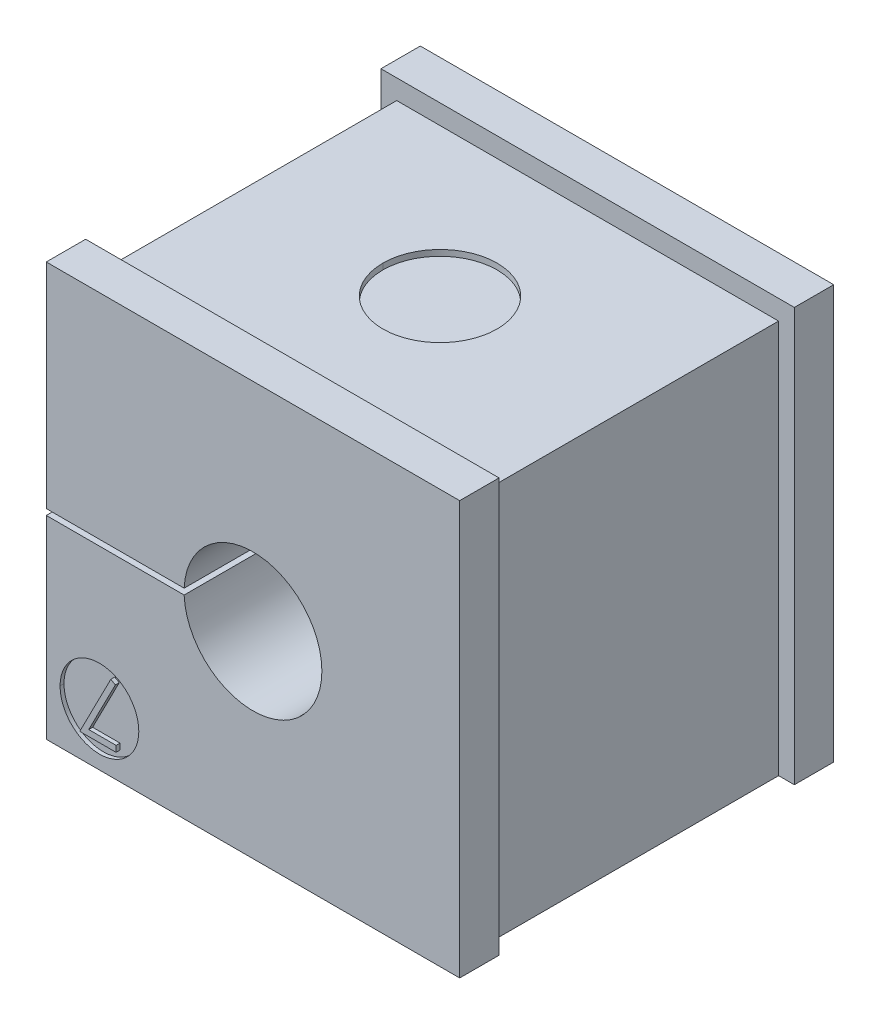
ISO-10303-21;
HEADER;
FILE_DESCRIPTION(('STEP AP214'),'2;1');
FILE_NAME('part.step','',(''),(''),'','','');
FILE_SCHEMA(('AUTOMOTIVE_DESIGN { 1 0 10303 214 1 1 1 1 }'));
ENDSEC;
DATA;
#1=APPLICATION_CONTEXT('core data for automotive mechanical design processes');
#2=APPLICATION_PROTOCOL_DEFINITION('international standard','automotive_design',2000,#1);
#3=PRODUCT_CONTEXT('',#1,'mechanical');
#4=PRODUCT('Part','Part','',(#3));
#5=PRODUCT_RELATED_PRODUCT_CATEGORY('part','',(#4));
#6=PRODUCT_DEFINITION_FORMATION('','',#4);
#7=PRODUCT_DEFINITION_CONTEXT('part definition',#1,'design');
#8=PRODUCT_DEFINITION('design','',#6,#7);
#9=PRODUCT_DEFINITION_SHAPE('','',#8);
#10=(LENGTH_UNIT() NAMED_UNIT(*) SI_UNIT(.MILLI.,.METRE.));
#11=(NAMED_UNIT(*) PLANE_ANGLE_UNIT() SI_UNIT($,.RADIAN.));
#12=(NAMED_UNIT(*) SI_UNIT($,.STERADIAN.) SOLID_ANGLE_UNIT());
#13=UNCERTAINTY_MEASURE_WITH_UNIT(LENGTH_MEASURE(1.E-05),#10,'distance_accuracy_value','');
#14=(GEOMETRIC_REPRESENTATION_CONTEXT(3) GLOBAL_UNCERTAINTY_ASSIGNED_CONTEXT((#13)) GLOBAL_UNIT_ASSIGNED_CONTEXT((#10,
#11,#12)) REPRESENTATION_CONTEXT('',''));
#15=CARTESIAN_POINT('',(0.,0.,0.));
#16=DIRECTION('',(0.,0.,1.));
#17=DIRECTION('',(1.,0.,0.));
#18=AXIS2_PLACEMENT_3D('',#15,#16,#17);
#19=CARTESIAN_POINT('',(0.,0.,9.5));
#20=DIRECTION('',(0.,0.,-1.));
#21=DIRECTION('',(0.,-1.,0.));
#22=AXIS2_PLACEMENT_3D('',#19,#20,#21);
#23=PLANE('',#22);
#24=DIRECTION('',(0.,-1.,0.));
#25=VECTOR('',#24,1.);
#26=CARTESIAN_POINT('',(3.54615384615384,-8.99230769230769,9.5));
#27=LINE('',#26,#25);
#28=CARTESIAN_POINT('',(3.54615384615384,-8.99230769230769,9.5));
#29=VERTEX_POINT('',#28);
#30=CARTESIAN_POINT('',(3.54615384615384,-9.3,9.5));
#31=VERTEX_POINT('',#30);
#32=EDGE_CURVE('E504',#29,#31,#27,.T.);
#33=ORIENTED_EDGE('',*,*,#32,.F.);
#34=DIRECTION('',(1.,0.,0.));
#35=VECTOR('',#34,1.);
#36=CARTESIAN_POINT('',(2.15552884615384,-8.99230769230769,9.5));
#37=LINE('',#36,#35);
#38=CARTESIAN_POINT('',(2.15552884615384,-8.99230769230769,9.5));
#39=VERTEX_POINT('',#38);
#40=EDGE_CURVE('E473',#39,#29,#37,.T.);
#41=ORIENTED_EDGE('',*,*,#40,.F.);
#42=DIRECTION('',(-0.456180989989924,-0.889887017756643,0.));
#43=VECTOR('',#42,1.);
#44=CARTESIAN_POINT('',(3.50949519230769,-6.35108173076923,9.5));
#45=LINE('',#44,#43);
#46=CARTESIAN_POINT('',(3.50949519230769,-6.35108173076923,9.5));
#47=VERTEX_POINT('',#46);
#48=EDGE_CURVE('E472',#47,#39,#45,.T.);
#49=ORIENTED_EDGE('',*,*,#48,.F.);
#50=DIRECTION('',(0.876072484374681,-0.482179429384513,0.));
#51=VECTOR('',#50,1.);
#52=CARTESIAN_POINT('',(3.27692307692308,-6.22307692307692,9.5));
#53=LINE('',#52,#51);
#54=CARTESIAN_POINT('',(3.27692307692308,-6.22307692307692,9.5));
#55=VERTEX_POINT('',#54);
#56=EDGE_CURVE('E509',#55,#47,#53,.T.);
#57=ORIENTED_EDGE('',*,*,#56,.F.);
#58=DIRECTION('',(0.456090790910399,0.889933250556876,0.));
#59=VECTOR('',#58,1.);
#60=CARTESIAN_POINT('',(1.7,-9.3,9.5));
#61=LINE('',#60,#59);
#62=CARTESIAN_POINT('',(1.7,-9.3,9.5));
#63=VERTEX_POINT('',#62);
#64=EDGE_CURVE('E23',#63,#55,#61,.T.);
#65=ORIENTED_EDGE('',*,*,#64,.F.);
#66=DIRECTION('',(-1.,0.,0.));
#67=VECTOR('',#66,1.);
#68=CARTESIAN_POINT('',(3.54615384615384,-9.3,9.5));
#69=LINE('',#68,#67);
#70=EDGE_CURVE('E9',#31,#63,#69,.T.);
#71=ORIENTED_EDGE('',*,*,#70,.F.);
#72=EDGE_LOOP('',(#33,#41,#49,#57,#65,#71));
#73=FACE_BOUND('',#72,.T.);
#74=ADVANCED_FACE('F15',(#73),#23,.F.);
#75=CARTESIAN_POINT('',(3.54615384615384,-9.3,9.5));
#76=DIRECTION('',(0.,-1.,0.));
#77=DIRECTION('',(0.,0.,-1.));
#78=AXIS2_PLACEMENT_3D('',#75,#76,#77);
#79=PLANE('',#78);
#80=DIRECTION('',(-1.,0.,0.));
#81=VECTOR('',#80,1.);
#82=CARTESIAN_POINT('',(3.54615384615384,-9.3,9.3));
#83=LINE('',#82,#81);
#84=CARTESIAN_POINT('',(3.54615384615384,-9.3,9.3));
#85=VERTEX_POINT('',#84);
#86=CARTESIAN_POINT('',(1.7,-9.3,9.3));
#87=VERTEX_POINT('',#86);
#88=EDGE_CURVE('E548',#85,#87,#83,.T.);
#89=ORIENTED_EDGE('',*,*,#88,.F.);
#90=DIRECTION('',(0.,0.,-1.));
#91=VECTOR('',#90,1.);
#92=CARTESIAN_POINT('',(3.54615384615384,-9.3,9.5));
#93=LINE('',#92,#91);
#94=EDGE_CURVE('E612',#31,#85,#93,.T.);
#95=ORIENTED_EDGE('',*,*,#94,.F.);
#96=ORIENTED_EDGE('',*,*,#70,.T.);
#97=DIRECTION('',(0.,0.,-1.));
#98=VECTOR('',#97,1.);
#99=CARTESIAN_POINT('',(1.7,-9.3,9.5));
#100=LINE('',#99,#98);
#101=EDGE_CURVE('E512',#63,#87,#100,.T.);
#102=ORIENTED_EDGE('',*,*,#101,.T.);
#103=EDGE_LOOP('',(#89,#95,#96,#102));
#104=FACE_BOUND('',#103,.T.);
#105=ADVANCED_FACE('F957',(#104),#79,.T.);
#106=CARTESIAN_POINT('',(1.7,-9.3,9.5));
#107=DIRECTION('',(-0.889933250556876,0.456090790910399,0.));
#108=DIRECTION('',(0.,0.,1.));
#109=AXIS2_PLACEMENT_3D('',#106,#107,#108);
#110=PLANE('',#109);
#111=DIRECTION('',(0.456090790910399,0.889933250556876,0.));
#112=VECTOR('',#111,1.);
#113=CARTESIAN_POINT('',(1.7,-9.3,9.3));
#114=LINE('',#113,#112);
#115=CARTESIAN_POINT('',(3.27692307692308,-6.22307692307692,9.3));
#116=VERTEX_POINT('',#115);
#117=EDGE_CURVE('E543',#87,#116,#114,.T.);
#118=ORIENTED_EDGE('',*,*,#117,.F.);
#119=ORIENTED_EDGE('',*,*,#101,.F.);
#120=ORIENTED_EDGE('',*,*,#64,.T.);
#121=DIRECTION('',(0.,0.,-1.));
#122=VECTOR('',#121,1.);
#123=CARTESIAN_POINT('',(3.27692307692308,-6.22307692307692,9.5));
#124=LINE('',#123,#122);
#125=EDGE_CURVE('E513',#55,#116,#124,.T.);
#126=ORIENTED_EDGE('',*,*,#125,.T.);
#127=EDGE_LOOP('',(#118,#119,#120,#126));
#128=FACE_BOUND('',#127,.T.);
#129=ADVANCED_FACE('F712',(#128),#110,.T.);
#130=CARTESIAN_POINT('',(3.27692307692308,-6.22307692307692,9.5));
#131=DIRECTION('',(0.482179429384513,0.876072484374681,0.));
#132=DIRECTION('',(0.,0.,-1.));
#133=AXIS2_PLACEMENT_3D('',#130,#131,#132);
#134=PLANE('',#133);
#135=DIRECTION('',(0.876072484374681,-0.482179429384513,0.));
#136=VECTOR('',#135,1.);
#137=CARTESIAN_POINT('',(3.27692307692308,-6.22307692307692,9.3));
#138=LINE('',#137,#136);
#139=CARTESIAN_POINT('',(3.50949519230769,-6.35108173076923,9.3));
#140=VERTEX_POINT('',#139);
#141=EDGE_CURVE('E547',#116,#140,#138,.T.);
#142=ORIENTED_EDGE('',*,*,#141,.F.);
#143=ORIENTED_EDGE('',*,*,#125,.F.);
#144=ORIENTED_EDGE('',*,*,#56,.T.);
#145=DIRECTION('',(0.,0.,-1.));
#146=VECTOR('',#145,1.);
#147=CARTESIAN_POINT('',(3.50949519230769,-6.35108173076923,9.5));
#148=LINE('',#147,#146);
#149=EDGE_CURVE('E469',#47,#140,#148,.T.);
#150=ORIENTED_EDGE('',*,*,#149,.T.);
#151=EDGE_LOOP('',(#142,#143,#144,#150));
#152=FACE_BOUND('',#151,.T.);
#153=ADVANCED_FACE('F706',(#152),#134,.T.);
#154=CARTESIAN_POINT('',(3.50949519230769,-6.35108173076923,9.5));
#155=DIRECTION('',(0.889887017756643,-0.456180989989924,0.));
#156=DIRECTION('',(0.,0.,-1.));
#157=AXIS2_PLACEMENT_3D('',#154,#155,#156);
#158=PLANE('',#157);
#159=DIRECTION('',(-0.456180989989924,-0.889887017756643,0.));
#160=VECTOR('',#159,1.);
#161=CARTESIAN_POINT('',(3.50949519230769,-6.35108173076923,9.3));
#162=LINE('',#161,#160);
#163=CARTESIAN_POINT('',(2.15552884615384,-8.99230769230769,9.3));
#164=VERTEX_POINT('',#163);
#165=EDGE_CURVE('E369',#140,#164,#162,.T.);
#166=ORIENTED_EDGE('',*,*,#165,.F.);
#167=ORIENTED_EDGE('',*,*,#149,.F.);
#168=ORIENTED_EDGE('',*,*,#48,.T.);
#169=DIRECTION('',(0.,0.,-1.));
#170=VECTOR('',#169,1.);
#171=CARTESIAN_POINT('',(2.15552884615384,-8.99230769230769,9.5));
#172=LINE('',#171,#170);
#173=EDGE_CURVE('E573',#39,#164,#172,.T.);
#174=ORIENTED_EDGE('',*,*,#173,.T.);
#175=EDGE_LOOP('',(#166,#167,#168,#174));
#176=FACE_BOUND('',#175,.T.);
#177=ADVANCED_FACE('F711',(#176),#158,.T.);
#178=CARTESIAN_POINT('',(2.15552884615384,-8.99230769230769,9.5));
#179=DIRECTION('',(0.,1.,0.));
#180=DIRECTION('',(1.,0.,0.));
#181=AXIS2_PLACEMENT_3D('',#178,#179,#180);
#182=PLANE('',#181);
#183=DIRECTION('',(1.,0.,0.));
#184=VECTOR('',#183,1.);
#185=CARTESIAN_POINT('',(2.15552884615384,-8.99230769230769,9.3));
#186=LINE('',#185,#184);
#187=CARTESIAN_POINT('',(3.54615384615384,-8.99230769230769,9.3));
#188=VERTEX_POINT('',#187);
#189=EDGE_CURVE('E364',#164,#188,#186,.T.);
#190=ORIENTED_EDGE('',*,*,#189,.F.);
#191=ORIENTED_EDGE('',*,*,#173,.F.);
#192=ORIENTED_EDGE('',*,*,#40,.T.);
#193=DIRECTION('',(0.,0.,-1.));
#194=VECTOR('',#193,1.);
#195=CARTESIAN_POINT('',(3.54615384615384,-8.99230769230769,9.5));
#196=LINE('',#195,#194);
#197=EDGE_CURVE('E368',#29,#188,#196,.T.);
#198=ORIENTED_EDGE('',*,*,#197,.T.);
#199=EDGE_LOOP('',(#190,#191,#192,#198));
#200=FACE_BOUND('',#199,.T.);
#201=ADVANCED_FACE('F771',(#200),#182,.T.);
#202=CARTESIAN_POINT('',(3.54615384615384,-8.99230769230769,9.5));
#203=DIRECTION('',(1.,0.,0.));
#204=DIRECTION('',(0.,1.,0.));
#205=AXIS2_PLACEMENT_3D('',#202,#203,#204);
#206=PLANE('',#205);
#207=DIRECTION('',(0.,-1.,0.));
#208=VECTOR('',#207,1.);
#209=CARTESIAN_POINT('',(3.54615384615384,-8.99230769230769,9.3));
#210=LINE('',#209,#208);
#211=EDGE_CURVE('E536',#188,#85,#210,.T.);
#212=ORIENTED_EDGE('',*,*,#211,.F.);
#213=ORIENTED_EDGE('',*,*,#197,.F.);
#214=ORIENTED_EDGE('',*,*,#32,.T.);
#215=ORIENTED_EDGE('',*,*,#94,.T.);
#216=EDGE_LOOP('',(#212,#213,#214,#215));
#217=FACE_BOUND('',#216,.T.);
#218=ADVANCED_FACE('F832',(#217),#206,.T.);
#219=CARTESIAN_POINT('',(10.5,-0.5,-19.3994949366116));
#220=DIRECTION('',(0.,0.,1.));
#221=DIRECTION('',(1.,0.,0.));
#222=AXIS2_PLACEMENT_3D('',#219,#220,#221);
#223=CYLINDRICAL_SURFACE('',#222,3.5);
#224=DIRECTION('',(0.,0.,1.));
#225=VECTOR('',#224,1.);
#226=CARTESIAN_POINT('',(14.,-0.5,-19.3994949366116));
#227=LINE('',#226,#225);
#228=CARTESIAN_POINT('',(14.,-0.5,-9.5));
#229=VERTEX_POINT('',#228);
#230=CARTESIAN_POINT('',(14.,-0.5,9.5));
#231=VERTEX_POINT('',#230);
#232=EDGE_CURVE('E298',#229,#231,#227,.T.);
#233=ORIENTED_EDGE('',*,*,#232,.F.);
#234=CARTESIAN_POINT('',(10.5,-0.5,-9.5));
#235=DIRECTION('',(0.,0.,1.));
#236=DIRECTION('',(-1.,0.,0.));
#237=AXIS2_PLACEMENT_3D('',#234,#235,#236);
#238=CIRCLE('',#237,3.5);
#239=CARTESIAN_POINT('',(7.00321576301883,-0.65,-9.5));
#240=VERTEX_POINT('',#239);
#241=EDGE_CURVE('E282',#240,#229,#238,.T.);
#242=ORIENTED_EDGE('',*,*,#241,.F.);
#243=DIRECTION('',(0.,0.,1.));
#244=VECTOR('',#243,1.);
#245=CARTESIAN_POINT('',(7.00321576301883,-0.65,-19.3994949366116));
#246=LINE('',#245,#244);
#247=CARTESIAN_POINT('',(7.00321576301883,-0.65,9.5));
#248=VERTEX_POINT('',#247);
#249=EDGE_CURVE('E362',#240,#248,#246,.T.);
#250=ORIENTED_EDGE('',*,*,#249,.T.);
#251=CARTESIAN_POINT('',(10.5,-0.5,9.5));
#252=DIRECTION('',(0.,0.,1.));
#253=DIRECTION('',(1.,0.,0.));
#254=AXIS2_PLACEMENT_3D('',#251,#252,#253);
#255=CIRCLE('',#254,3.5);
#256=EDGE_CURVE('E300',#248,#231,#255,.T.);
#257=ORIENTED_EDGE('',*,*,#256,.T.);
#258=EDGE_LOOP('',(#233,#242,#250,#257));
#259=FACE_BOUND('',#258,.T.);
#260=ADVANCED_FACE('F299',(#259),#223,.F.);
#261=CARTESIAN_POINT('',(2.7,-7.8,9.3));
#262=DIRECTION('',(0.,0.,1.));
#263=DIRECTION('',(1.,0.,0.));
#264=AXIS2_PLACEMENT_3D('',#261,#262,#263);
#265=PLANE('',#264);
#266=ORIENTED_EDGE('',*,*,#211,.T.);
#267=ORIENTED_EDGE('',*,*,#88,.T.);
#268=ORIENTED_EDGE('',*,*,#117,.T.);
#269=ORIENTED_EDGE('',*,*,#141,.T.);
#270=ORIENTED_EDGE('',*,*,#165,.T.);
#271=ORIENTED_EDGE('',*,*,#189,.T.);
#272=EDGE_LOOP('',(#266,#267,#268,#269,#270,#271));
#273=FACE_BOUND('',#272,.T.);
#274=CARTESIAN_POINT('',(2.7,-7.8,9.3));
#275=DIRECTION('',(0.,0.,1.));
#276=DIRECTION('',(1.,0.,0.));
#277=AXIS2_PLACEMENT_3D('',#274,#275,#276);
#278=CIRCLE('',#277,2.);
#279=CARTESIAN_POINT('',(4.7,-7.8,9.3));
#280=VERTEX_POINT('',#279);
#281=CARTESIAN_POINT('',(0.7,-7.8,9.3));
#282=VERTEX_POINT('',#281);
#283=EDGE_CURVE('E533',#280,#282,#278,.T.);
#284=ORIENTED_EDGE('',*,*,#283,.T.);
#285=CARTESIAN_POINT('',(2.7,-7.8,9.3));
#286=DIRECTION('',(0.,0.,1.));
#287=DIRECTION('',(1.,0.,0.));
#288=AXIS2_PLACEMENT_3D('',#285,#286,#287);
#289=CIRCLE('',#288,2.);
#290=EDGE_CURVE('E340',#282,#280,#289,.T.);
#291=ORIENTED_EDGE('',*,*,#290,.T.);
#292=EDGE_LOOP('',(#284,#291));
#293=FACE_BOUND('',#292,.T.);
#294=ADVANCED_FACE('F924',(#273,#293),#265,.T.);
#295=CARTESIAN_POINT('',(2.7,-7.8,9.3));
#296=DIRECTION('',(0.,0.,1.));
#297=DIRECTION('',(1.,0.,0.));
#298=AXIS2_PLACEMENT_3D('',#295,#296,#297);
#299=CYLINDRICAL_SURFACE('',#298,2.);
#300=DIRECTION('',(0.,0.,1.));
#301=VECTOR('',#300,1.);
#302=CARTESIAN_POINT('',(0.7,-7.8,9.3));
#303=LINE('',#302,#301);
#304=CARTESIAN_POINT('',(0.7,-7.8,9.5));
#305=VERTEX_POINT('',#304);
#306=EDGE_CURVE('E355',#282,#305,#303,.T.);
#307=ORIENTED_EDGE('',*,*,#306,.F.);
#308=ORIENTED_EDGE('',*,*,#283,.F.);
#309=DIRECTION('',(0.,0.,1.));
#310=VECTOR('',#309,1.);
#311=CARTESIAN_POINT('',(4.7,-7.8,9.3));
#312=LINE('',#311,#310);
#313=CARTESIAN_POINT('',(4.7,-7.8,9.5));
#314=VERTEX_POINT('',#313);
#315=EDGE_CURVE('E337',#280,#314,#312,.T.);
#316=ORIENTED_EDGE('',*,*,#315,.T.);
#317=CARTESIAN_POINT('',(2.7,-7.8,9.5));
#318=DIRECTION('',(0.,0.,1.));
#319=DIRECTION('',(1.,0.,0.));
#320=AXIS2_PLACEMENT_3D('',#317,#318,#319);
#321=CIRCLE('',#320,2.);
#322=EDGE_CURVE('E295',#314,#305,#321,.T.);
#323=ORIENTED_EDGE('',*,*,#322,.T.);
#324=EDGE_LOOP('',(#307,#308,#316,#323));
#325=FACE_BOUND('',#324,.T.);
#326=ADVANCED_FACE('F914',(#325),#299,.F.);
#327=CARTESIAN_POINT('',(10.5,9.2,0.));
#328=DIRECTION('',(0.,1.,0.));
#329=DIRECTION('',(-1.,0.,0.));
#330=AXIS2_PLACEMENT_3D('',#327,#328,#329);
#331=CYLINDRICAL_SURFACE('',#330,2.9);
#332=DIRECTION('',(0.,1.,0.));
#333=VECTOR('',#332,1.);
#334=CARTESIAN_POINT('',(13.4,9.2,0.));
#335=LINE('',#334,#333);
#336=CARTESIAN_POINT('',(13.4,9.2,0.));
#337=VERTEX_POINT('',#336);
#338=CARTESIAN_POINT('',(13.4,9.5,0.));
#339=VERTEX_POINT('',#338);
#340=EDGE_CURVE('E336',#337,#339,#335,.T.);
#341=ORIENTED_EDGE('',*,*,#340,.F.);
#342=CARTESIAN_POINT('',(10.5,9.2,0.));
#343=DIRECTION('',(0.,1.,0.));
#344=DIRECTION('',(-1.,0.,0.));
#345=AXIS2_PLACEMENT_3D('',#342,#343,#344);
#346=CIRCLE('',#345,2.9);
#347=CARTESIAN_POINT('',(7.6,9.2,0.));
#348=VERTEX_POINT('',#347);
#349=EDGE_CURVE('E294',#348,#337,#346,.T.);
#350=ORIENTED_EDGE('',*,*,#349,.F.);
#351=DIRECTION('',(0.,1.,0.));
#352=VECTOR('',#351,1.);
#353=CARTESIAN_POINT('',(7.6,9.2,0.));
#354=LINE('',#353,#352);
#355=CARTESIAN_POINT('',(7.6,9.5,0.));
#356=VERTEX_POINT('',#355);
#357=EDGE_CURVE('E363',#348,#356,#354,.T.);
#358=ORIENTED_EDGE('',*,*,#357,.T.);
#359=CARTESIAN_POINT('',(10.5,9.5,0.));
#360=DIRECTION('',(0.,-1.,0.));
#361=DIRECTION('',(1.,0.,0.));
#362=AXIS2_PLACEMENT_3D('',#359,#360,#361);
#363=CIRCLE('',#362,2.9);
#364=EDGE_CURVE('E420',#339,#356,#363,.T.);
#365=ORIENTED_EDGE('',*,*,#364,.F.);
#366=EDGE_LOOP('',(#341,#350,#358,#365));
#367=FACE_BOUND('',#366,.T.);
#368=ADVANCED_FACE('F904',(#367),#331,.F.);
#369=CARTESIAN_POINT('',(10.5,9.2,0.));
#370=DIRECTION('',(0.,1.,0.));
#371=DIRECTION('',(1.,0.,0.));
#372=AXIS2_PLACEMENT_3D('',#369,#370,#371);
#373=PLANE('',#372);
#374=ORIENTED_EDGE('',*,*,#349,.T.);
#375=CARTESIAN_POINT('',(10.5,9.2,0.));
#376=DIRECTION('',(0.,1.,0.));
#377=DIRECTION('',(-1.,0.,0.));
#378=AXIS2_PLACEMENT_3D('',#375,#376,#377);
#379=CIRCLE('',#378,2.9);
#380=EDGE_CURVE('E332',#337,#348,#379,.T.);
#381=ORIENTED_EDGE('',*,*,#380,.T.);
#382=EDGE_LOOP('',(#374,#381));
#383=FACE_BOUND('',#382,.T.);
#384=ADVANCED_FACE('F894',(#383),#373,.T.);
#385=CARTESIAN_POINT('',(1.3,0.,7.5));
#386=DIRECTION('',(0.,0.,1.));
#387=DIRECTION('',(1.,0.,0.));
#388=AXIS2_PLACEMENT_3D('',#385,#386,#387);
#389=PLANE('',#388);
#390=DIRECTION('',(0.,1.,0.));
#391=VECTOR('',#390,1.);
#392=CARTESIAN_POINT('',(0.,0.,7.5));
#393=LINE('',#392,#391);
#394=CARTESIAN_POINT('',(0.,-10.5,7.5));
#395=VERTEX_POINT('',#394);
#396=CARTESIAN_POINT('',(0.,-0.65,7.5));
#397=VERTEX_POINT('',#396);
#398=EDGE_CURVE('E581',#395,#397,#393,.T.);
#399=ORIENTED_EDGE('',*,*,#398,.T.);
#400=DIRECTION('',(1.,0.,0.));
#401=VECTOR('',#400,1.);
#402=CARTESIAN_POINT('',(1.3,-0.65,7.5));
#403=LINE('',#402,#401);
#404=CARTESIAN_POINT('',(0.8,-0.65,7.5));
#405=VERTEX_POINT('',#404);
#406=EDGE_CURVE('E410',#397,#405,#403,.T.);
#407=ORIENTED_EDGE('',*,*,#406,.T.);
#408=DIRECTION('',(0.,1.,0.));
#409=VECTOR('',#408,1.);
#410=CARTESIAN_POINT('',(0.8,9.5,7.5));
#411=LINE('',#410,#409);
#412=CARTESIAN_POINT('',(0.8,-10.5,7.5));
#413=VERTEX_POINT('',#412);
#414=EDGE_CURVE('E414',#413,#405,#411,.T.);
#415=ORIENTED_EDGE('',*,*,#414,.F.);
#416=DIRECTION('',(1.,0.,0.));
#417=VECTOR('',#416,1.);
#418=CARTESIAN_POINT('',(1.3,-10.5,7.5));
#419=LINE('',#418,#417);
#420=EDGE_CURVE('E485',#395,#413,#419,.T.);
#421=ORIENTED_EDGE('',*,*,#420,.F.);
#422=EDGE_LOOP('',(#399,#407,#415,#421));
#423=FACE_BOUND('',#422,.T.);
#424=ADVANCED_FACE('F884',(#423),#389,.F.);
#425=CARTESIAN_POINT('',(0.,0.,-7.5));
#426=DIRECTION('',(0.,0.,-1.));
#427=DIRECTION('',(-1.,0.,0.));
#428=AXIS2_PLACEMENT_3D('',#425,#426,#427);
#429=PLANE('',#428);
#430=DIRECTION('',(0.,-1.,0.));
#431=VECTOR('',#430,1.);
#432=CARTESIAN_POINT('',(0.8,9.5,-7.5));
#433=LINE('',#432,#431);
#434=CARTESIAN_POINT('',(0.8,-0.65,-7.5));
#435=VERTEX_POINT('',#434);
#436=CARTESIAN_POINT('',(0.8,-10.5,-7.5));
#437=VERTEX_POINT('',#436);
#438=EDGE_CURVE('E590',#435,#437,#433,.T.);
#439=ORIENTED_EDGE('',*,*,#438,.F.);
#440=DIRECTION('',(-1.,0.,0.));
#441=VECTOR('',#440,1.);
#442=CARTESIAN_POINT('',(0.,-0.65,-7.5));
#443=LINE('',#442,#441);
#444=CARTESIAN_POINT('',(0.,-0.65,-7.5));
#445=VERTEX_POINT('',#444);
#446=EDGE_CURVE('E345',#435,#445,#443,.T.);
#447=ORIENTED_EDGE('',*,*,#446,.T.);
#448=DIRECTION('',(0.,1.,0.));
#449=VECTOR('',#448,1.);
#450=CARTESIAN_POINT('',(0.,0.,-7.5));
#451=LINE('',#450,#449);
#452=CARTESIAN_POINT('',(0.,-10.5,-7.5));
#453=VERTEX_POINT('',#452);
#454=EDGE_CURVE('E415',#453,#445,#451,.T.);
#455=ORIENTED_EDGE('',*,*,#454,.F.);
#456=DIRECTION('',(-1.,0.,0.));
#457=VECTOR('',#456,1.);
#458=CARTESIAN_POINT('',(0.,-10.5,-7.5));
#459=LINE('',#458,#457);
#460=EDGE_CURVE('E374',#437,#453,#459,.T.);
#461=ORIENTED_EDGE('',*,*,#460,.F.);
#462=EDGE_LOOP('',(#439,#447,#455,#461));
#463=FACE_BOUND('',#462,.T.);
#464=ADVANCED_FACE('F875',(#463),#429,.F.);
#465=CARTESIAN_POINT('',(0.,0.,-9.5));
#466=DIRECTION('',(0.,0.,-1.));
#467=DIRECTION('',(0.,-1.,0.));
#468=AXIS2_PLACEMENT_3D('',#465,#466,#467);
#469=PLANE('',#468);
#470=DIRECTION('',(-1.,0.,0.));
#471=VECTOR('',#470,1.);
#472=CARTESIAN_POINT('',(0.,-0.35,-9.5));
#473=LINE('',#472,#471);
#474=CARTESIAN_POINT('',(7.00321576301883,-0.35,-9.5));
#475=VERTEX_POINT('',#474);
#476=CARTESIAN_POINT('',(0.,-0.35,-9.5));
#477=VERTEX_POINT('',#476);
#478=EDGE_CURVE('E431',#475,#477,#473,.T.);
#479=ORIENTED_EDGE('',*,*,#478,.T.);
#480=DIRECTION('',(0.,-1.,0.));
#481=VECTOR('',#480,1.);
#482=CARTESIAN_POINT('',(0.,0.,-9.5));
#483=LINE('',#482,#481);
#484=CARTESIAN_POINT('',(0.,10.5,-9.5));
#485=VERTEX_POINT('',#484);
#486=EDGE_CURVE('E480',#485,#477,#483,.T.);
#487=ORIENTED_EDGE('',*,*,#486,.F.);
#488=DIRECTION('',(-1.,0.,0.));
#489=VECTOR('',#488,1.);
#490=CARTESIAN_POINT('',(0.,10.5,-9.5));
#491=LINE('',#490,#489);
#492=CARTESIAN_POINT('',(21.,10.5,-9.5));
#493=VERTEX_POINT('',#492);
#494=EDGE_CURVE('E435',#493,#485,#491,.T.);
#495=ORIENTED_EDGE('',*,*,#494,.F.);
#496=DIRECTION('',(0.,-1.,0.));
#497=VECTOR('',#496,1.);
#498=CARTESIAN_POINT('',(21.,0.,-9.5));
#499=LINE('',#498,#497);
#500=CARTESIAN_POINT('',(21.,-10.5,-9.5));
#501=VERTEX_POINT('',#500);
#502=EDGE_CURVE('E323',#493,#501,#499,.T.);
#503=ORIENTED_EDGE('',*,*,#502,.T.);
#504=DIRECTION('',(-1.,0.,0.));
#505=VECTOR('',#504,1.);
#506=CARTESIAN_POINT('',(0.,-10.5,-9.5));
#507=LINE('',#506,#505);
#508=CARTESIAN_POINT('',(0.,-10.5,-9.5));
#509=VERTEX_POINT('',#508);
#510=EDGE_CURVE('E560',#501,#509,#507,.T.);
#511=ORIENTED_EDGE('',*,*,#510,.T.);
#512=DIRECTION('',(0.,-1.,0.));
#513=VECTOR('',#512,1.);
#514=CARTESIAN_POINT('',(0.,0.,-9.5));
#515=LINE('',#514,#513);
#516=CARTESIAN_POINT('',(0.,-0.65,-9.5));
#517=VERTEX_POINT('',#516);
#518=EDGE_CURVE('E411',#517,#509,#515,.T.);
#519=ORIENTED_EDGE('',*,*,#518,.F.);
#520=DIRECTION('',(1.,0.,0.));
#521=VECTOR('',#520,1.);
#522=CARTESIAN_POINT('',(0.,-0.65,-9.5));
#523=LINE('',#522,#521);
#524=EDGE_CURVE('E289',#517,#240,#523,.T.);
#525=ORIENTED_EDGE('',*,*,#524,.T.);
#526=ORIENTED_EDGE('',*,*,#241,.T.);
#527=CARTESIAN_POINT('',(10.5,-0.5,-9.5));
#528=DIRECTION('',(0.,0.,1.));
#529=DIRECTION('',(-1.,0.,0.));
#530=AXIS2_PLACEMENT_3D('',#527,#528,#529);
#531=CIRCLE('',#530,3.5);
#532=EDGE_CURVE('E287',#229,#475,#531,.T.);
#533=ORIENTED_EDGE('',*,*,#532,.T.);
#534=EDGE_LOOP('',(#479,#487,#495,#503,#511,#519,#525,#526,#533));
#535=FACE_BOUND('',#534,.T.);
#536=ADVANCED_FACE('F285',(#535),#469,.T.);
#537=CARTESIAN_POINT('',(0.,0.,9.5));
#538=DIRECTION('',(0.,0.,-1.));
#539=DIRECTION('',(0.,-1.,0.));
#540=AXIS2_PLACEMENT_3D('',#537,#538,#539);
#541=PLANE('',#540);
#542=ORIENTED_EDGE('',*,*,#322,.F.);
#543=CARTESIAN_POINT('',(2.7,-7.8,9.5));
#544=DIRECTION('',(0.,0.,1.));
#545=DIRECTION('',(1.,0.,0.));
#546=AXIS2_PLACEMENT_3D('',#543,#544,#545);
#547=CIRCLE('',#546,2.);
#548=EDGE_CURVE('E379',#305,#314,#547,.T.);
#549=ORIENTED_EDGE('',*,*,#548,.F.);
#550=EDGE_LOOP('',(#542,#549));
#551=FACE_BOUND('',#550,.T.);
#552=DIRECTION('',(0.,-1.,0.));
#553=VECTOR('',#552,1.);
#554=CARTESIAN_POINT('',(0.,0.,9.5));
#555=LINE('',#554,#553);
#556=CARTESIAN_POINT('',(0.,10.5,9.5));
#557=VERTEX_POINT('',#556);
#558=CARTESIAN_POINT('',(0.,-0.35,9.5));
#559=VERTEX_POINT('',#558);
#560=EDGE_CURVE('E468',#557,#559,#555,.T.);
#561=ORIENTED_EDGE('',*,*,#560,.T.);
#562=DIRECTION('',(-1.,0.,0.));
#563=VECTOR('',#562,1.);
#564=CARTESIAN_POINT('',(0.,-0.35,9.5));
#565=LINE('',#564,#563);
#566=CARTESIAN_POINT('',(7.00321576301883,-0.35,9.5));
#567=VERTEX_POINT('',#566);
#568=EDGE_CURVE('E438',#567,#559,#565,.T.);
#569=ORIENTED_EDGE('',*,*,#568,.F.);
#570=CARTESIAN_POINT('',(10.5,-0.5,9.5));
#571=DIRECTION('',(0.,0.,1.));
#572=DIRECTION('',(1.,0.,0.));
#573=AXIS2_PLACEMENT_3D('',#570,#571,#572);
#574=CIRCLE('',#573,3.5);
#575=EDGE_CURVE('E305',#231,#567,#574,.T.);
#576=ORIENTED_EDGE('',*,*,#575,.F.);
#577=ORIENTED_EDGE('',*,*,#256,.F.);
#578=DIRECTION('',(1.,0.,0.));
#579=VECTOR('',#578,1.);
#580=CARTESIAN_POINT('',(0.,-0.65,9.5));
#581=LINE('',#580,#579);
#582=CARTESIAN_POINT('',(0.,-0.65,9.5));
#583=VERTEX_POINT('',#582);
#584=EDGE_CURVE('E358',#583,#248,#581,.T.);
#585=ORIENTED_EDGE('',*,*,#584,.F.);
#586=DIRECTION('',(0.,-1.,0.));
#587=VECTOR('',#586,1.);
#588=CARTESIAN_POINT('',(0.,0.,9.5));
#589=LINE('',#588,#587);
#590=CARTESIAN_POINT('',(0.,-10.5,9.5));
#591=VERTEX_POINT('',#590);
#592=EDGE_CURVE('E322',#583,#591,#589,.T.);
#593=ORIENTED_EDGE('',*,*,#592,.T.);
#594=DIRECTION('',(-1.,0.,0.));
#595=VECTOR('',#594,1.);
#596=CARTESIAN_POINT('',(0.,-10.5,9.5));
#597=LINE('',#596,#595);
#598=CARTESIAN_POINT('',(21.,-10.5,9.5));
#599=VERTEX_POINT('',#598);
#600=EDGE_CURVE('E486',#599,#591,#597,.T.);
#601=ORIENTED_EDGE('',*,*,#600,.F.);
#602=DIRECTION('',(0.,-1.,0.));
#603=VECTOR('',#602,1.);
#604=CARTESIAN_POINT('',(21.,0.,9.5));
#605=LINE('',#604,#603);
#606=CARTESIAN_POINT('',(21.,10.5,9.5));
#607=VERTEX_POINT('',#606);
#608=EDGE_CURVE('E319',#607,#599,#605,.T.);
#609=ORIENTED_EDGE('',*,*,#608,.F.);
#610=DIRECTION('',(-1.,0.,0.));
#611=VECTOR('',#610,1.);
#612=CARTESIAN_POINT('',(0.,10.5,9.5));
#613=LINE('',#612,#611);
#614=EDGE_CURVE('E419',#607,#557,#613,.T.);
#615=ORIENTED_EDGE('',*,*,#614,.T.);
#616=EDGE_LOOP('',(#561,#569,#576,#577,#585,#593,#601,#609,#615));
#617=FACE_BOUND('',#616,.T.);
#618=ADVANCED_FACE('F856',(#551,#617),#541,.F.);
#619=CARTESIAN_POINT('',(0.8,0.,1.75));
#620=DIRECTION('',(1.,0.,0.));
#621=DIRECTION('',(0.,0.,-1.));
#622=AXIS2_PLACEMENT_3D('',#619,#620,#621);
#623=PLANE('',#622);
#624=ORIENTED_EDGE('',*,*,#414,.T.);
#625=DIRECTION('',(0.,0.,-1.));
#626=VECTOR('',#625,1.);
#627=CARTESIAN_POINT('',(0.8,-0.65,1.75));
#628=LINE('',#627,#626);
#629=EDGE_CURVE('E406',#405,#435,#628,.T.);
#630=ORIENTED_EDGE('',*,*,#629,.T.);
#631=ORIENTED_EDGE('',*,*,#438,.T.);
#632=DIRECTION('',(0.,0.,-1.));
#633=VECTOR('',#632,1.);
#634=CARTESIAN_POINT('',(0.8,-10.5,1.75));
#635=LINE('',#634,#633);
#636=EDGE_CURVE('E370',#413,#437,#635,.T.);
#637=ORIENTED_EDGE('',*,*,#636,.F.);
#638=EDGE_LOOP('',(#624,#630,#631,#637));
#639=FACE_BOUND('',#638,.T.);
#640=ADVANCED_FACE('F846',(#639),#623,.F.);
#641=CARTESIAN_POINT('',(0.,0.,9.5));
#642=DIRECTION('',(1.,0.,0.));
#643=DIRECTION('',(0.,1.,0.));
#644=AXIS2_PLACEMENT_3D('',#641,#642,#643);
#645=PLANE('',#644);
#646=ORIENTED_EDGE('',*,*,#454,.T.);
#647=DIRECTION('',(0.,0.,1.));
#648=VECTOR('',#647,1.);
#649=CARTESIAN_POINT('',(0.,-0.65,-9.5));
#650=LINE('',#649,#648);
#651=EDGE_CURVE('E341',#517,#445,#650,.T.);
#652=ORIENTED_EDGE('',*,*,#651,.F.);
#653=ORIENTED_EDGE('',*,*,#518,.T.);
#654=DIRECTION('',(0.,0.,-1.));
#655=VECTOR('',#654,1.);
#656=CARTESIAN_POINT('',(0.,-10.5,9.5));
#657=LINE('',#656,#655);
#658=EDGE_CURVE('E556',#453,#509,#657,.T.);
#659=ORIENTED_EDGE('',*,*,#658,.F.);
#660=EDGE_LOOP('',(#646,#652,#653,#659));
#661=FACE_BOUND('',#660,.T.);
#662=ADVANCED_FACE('F825',(#661),#645,.F.);
#663=CARTESIAN_POINT('',(0.,0.,9.5));
#664=DIRECTION('',(1.,0.,0.));
#665=DIRECTION('',(0.,1.,0.));
#666=AXIS2_PLACEMENT_3D('',#663,#664,#665);
#667=PLANE('',#666);
#668=ORIENTED_EDGE('',*,*,#592,.F.);
#669=DIRECTION('',(0.,0.,1.));
#670=VECTOR('',#669,1.);
#671=CARTESIAN_POINT('',(0.,-0.65,-9.5));
#672=LINE('',#671,#670);
#673=EDGE_CURVE('E424',#397,#583,#672,.T.);
#674=ORIENTED_EDGE('',*,*,#673,.F.);
#675=ORIENTED_EDGE('',*,*,#398,.F.);
#676=DIRECTION('',(0.,0.,-1.));
#677=VECTOR('',#676,1.);
#678=CARTESIAN_POINT('',(0.,-10.5,9.5));
#679=LINE('',#678,#677);
#680=EDGE_CURVE('E481',#591,#395,#679,.T.);
#681=ORIENTED_EDGE('',*,*,#680,.F.);
#682=EDGE_LOOP('',(#668,#674,#675,#681));
#683=FACE_BOUND('',#682,.T.);
#684=ADVANCED_FACE('F815',(#683),#667,.F.);
#685=CARTESIAN_POINT('',(21.,0.,9.5));
#686=DIRECTION('',(1.,0.,0.));
#687=DIRECTION('',(0.,1.,0.));
#688=AXIS2_PLACEMENT_3D('',#685,#686,#687);
#689=PLANE('',#688);
#690=DIRECTION('',(0.,0.,-1.));
#691=VECTOR('',#690,1.);
#692=CARTESIAN_POINT('',(21.,-10.5,9.5));
#693=LINE('',#692,#691);
#694=CARTESIAN_POINT('',(21.,-10.5,7.5));
#695=VERTEX_POINT('',#694);
#696=EDGE_CURVE('E568',#599,#695,#693,.T.);
#697=ORIENTED_EDGE('',*,*,#696,.T.);
#698=DIRECTION('',(0.,1.,0.));
#699=VECTOR('',#698,1.);
#700=CARTESIAN_POINT('',(21.,-10.5,7.5));
#701=LINE('',#700,#699);
#702=CARTESIAN_POINT('',(21.,10.5,7.5));
#703=VERTEX_POINT('',#702);
#704=EDGE_CURVE('E396',#695,#703,#701,.T.);
#705=ORIENTED_EDGE('',*,*,#704,.T.);
#706=DIRECTION('',(0.,0.,-1.));
#707=VECTOR('',#706,1.);
#708=CARTESIAN_POINT('',(21.,10.5,9.5));
#709=LINE('',#708,#707);
#710=EDGE_CURVE('E416',#607,#703,#709,.T.);
#711=ORIENTED_EDGE('',*,*,#710,.F.);
#712=ORIENTED_EDGE('',*,*,#608,.T.);
#713=EDGE_LOOP('',(#697,#705,#711,#712));
#714=FACE_BOUND('',#713,.T.);
#715=ADVANCED_FACE('F805',(#714),#689,.T.);
#716=CARTESIAN_POINT('',(21.,0.,9.5));
#717=DIRECTION('',(1.,0.,0.));
#718=DIRECTION('',(0.,1.,0.));
#719=AXIS2_PLACEMENT_3D('',#716,#717,#718);
#720=PLANE('',#719);
#721=DIRECTION('',(0.,1.,0.));
#722=VECTOR('',#721,1.);
#723=CARTESIAN_POINT('',(21.,-10.5,-7.5));
#724=LINE('',#723,#722);
#725=CARTESIAN_POINT('',(21.,-10.5,-7.5));
#726=VERTEX_POINT('',#725);
#727=CARTESIAN_POINT('',(21.,10.5,-7.5));
#728=VERTEX_POINT('',#727);
#729=EDGE_CURVE('E330',#726,#728,#724,.T.);
#730=ORIENTED_EDGE('',*,*,#729,.F.);
#731=DIRECTION('',(0.,0.,-1.));
#732=VECTOR('',#731,1.);
#733=CARTESIAN_POINT('',(21.,-10.5,9.5));
#734=LINE('',#733,#732);
#735=EDGE_CURVE('E564',#726,#501,#734,.T.);
#736=ORIENTED_EDGE('',*,*,#735,.T.);
#737=ORIENTED_EDGE('',*,*,#502,.F.);
#738=DIRECTION('',(0.,0.,-1.));
#739=VECTOR('',#738,1.);
#740=CARTESIAN_POINT('',(21.,10.5,9.5));
#741=LINE('',#740,#739);
#742=EDGE_CURVE('E427',#728,#493,#741,.T.);
#743=ORIENTED_EDGE('',*,*,#742,.F.);
#744=EDGE_LOOP('',(#730,#736,#737,#743));
#745=FACE_BOUND('',#744,.T.);
#746=ADVANCED_FACE('F689',(#745),#720,.T.);
#747=CARTESIAN_POINT('',(0.,-10.5,9.5));
#748=DIRECTION('',(0.,-1.,0.));
#749=DIRECTION('',(0.,0.,-1.));
#750=AXIS2_PLACEMENT_3D('',#747,#748,#749);
#751=PLANE('',#750);
#752=ORIENTED_EDGE('',*,*,#636,.T.);
#753=ORIENTED_EDGE('',*,*,#460,.T.);
#754=ORIENTED_EDGE('',*,*,#658,.T.);
#755=ORIENTED_EDGE('',*,*,#510,.F.);
#756=ORIENTED_EDGE('',*,*,#735,.F.);
#757=DIRECTION('',(1.,0.,0.));
#758=VECTOR('',#757,1.);
#759=CARTESIAN_POINT('',(21.,-10.5,-7.5));
#760=LINE('',#759,#758);
#761=CARTESIAN_POINT('',(20.2,-10.5,-7.5));
#762=VERTEX_POINT('',#761);
#763=EDGE_CURVE('E326',#762,#726,#760,.T.);
#764=ORIENTED_EDGE('',*,*,#763,.F.);
#765=DIRECTION('',(0.,0.,-1.));
#766=VECTOR('',#765,1.);
#767=CARTESIAN_POINT('',(20.2,-10.5,1.75));
#768=LINE('',#767,#766);
#769=CARTESIAN_POINT('',(20.2,-10.5,7.5));
#770=VERTEX_POINT('',#769);
#771=EDGE_CURVE('E375',#770,#762,#768,.T.);
#772=ORIENTED_EDGE('',*,*,#771,.F.);
#773=DIRECTION('',(-1.,0.,0.));
#774=VECTOR('',#773,1.);
#775=CARTESIAN_POINT('',(19.7,-10.5,7.5));
#776=LINE('',#775,#774);
#777=EDGE_CURVE('E316',#695,#770,#776,.T.);
#778=ORIENTED_EDGE('',*,*,#777,.F.);
#779=ORIENTED_EDGE('',*,*,#696,.F.);
#780=ORIENTED_EDGE('',*,*,#600,.T.);
#781=ORIENTED_EDGE('',*,*,#680,.T.);
#782=ORIENTED_EDGE('',*,*,#420,.T.);
#783=EDGE_LOOP('',(#752,#753,#754,#755,#756,#764,#772,#778,#779,#780,#781,#782));
#784=FACE_BOUND('',#783,.T.);
#785=ADVANCED_FACE('F644',(#784),#751,.T.);
#786=CARTESIAN_POINT('',(20.2,-10.5,-5.5));
#787=DIRECTION('',(1.,0.,0.));
#788=DIRECTION('',(0.,1.,0.));
#789=AXIS2_PLACEMENT_3D('',#786,#787,#788);
#790=PLANE('',#789);
#791=ORIENTED_EDGE('',*,*,#771,.T.);
#792=DIRECTION('',(0.,1.,0.));
#793=VECTOR('',#792,1.);
#794=CARTESIAN_POINT('',(20.2,9.5,-7.5));
#795=LINE('',#794,#793);
#796=CARTESIAN_POINT('',(20.2,9.5,-7.5));
#797=VERTEX_POINT('',#796);
#798=EDGE_CURVE('E331',#762,#797,#795,.T.);
#799=ORIENTED_EDGE('',*,*,#798,.T.);
#800=DIRECTION('',(0.,0.,1.));
#801=VECTOR('',#800,1.);
#802=CARTESIAN_POINT('',(20.2,9.5,-5.5));
#803=LINE('',#802,#801);
#804=CARTESIAN_POINT('',(20.2,9.5,7.5));
#805=VERTEX_POINT('',#804);
#806=EDGE_CURVE('E540',#797,#805,#803,.T.);
#807=ORIENTED_EDGE('',*,*,#806,.T.);
#808=DIRECTION('',(0.,-1.,0.));
#809=VECTOR('',#808,1.);
#810=CARTESIAN_POINT('',(20.2,9.5,7.5));
#811=LINE('',#810,#809);
#812=EDGE_CURVE('E528',#805,#770,#811,.T.);
#813=ORIENTED_EDGE('',*,*,#812,.T.);
#814=EDGE_LOOP('',(#791,#799,#807,#813));
#815=FACE_BOUND('',#814,.T.);
#816=ADVANCED_FACE('F638',(#815),#790,.T.);
#817=CARTESIAN_POINT('',(0.,10.5,9.5));
#818=DIRECTION('',(0.,-1.,0.));
#819=DIRECTION('',(0.,0.,-1.));
#820=AXIS2_PLACEMENT_3D('',#817,#818,#819);
#821=PLANE('',#820);
#822=DIRECTION('',(-1.,0.,0.));
#823=VECTOR('',#822,1.);
#824=CARTESIAN_POINT('',(0.,10.5,-7.5));
#825=LINE('',#824,#823);
#826=CARTESIAN_POINT('',(0.,10.5,-7.5));
#827=VERTEX_POINT('',#826);
#828=EDGE_CURVE('E397',#728,#827,#825,.T.);
#829=ORIENTED_EDGE('',*,*,#828,.F.);
#830=ORIENTED_EDGE('',*,*,#742,.T.);
#831=ORIENTED_EDGE('',*,*,#494,.T.);
#832=DIRECTION('',(0.,0.,-1.));
#833=VECTOR('',#832,1.);
#834=CARTESIAN_POINT('',(0.,10.5,9.5));
#835=LINE('',#834,#833);
#836=EDGE_CURVE('E496',#827,#485,#835,.T.);
#837=ORIENTED_EDGE('',*,*,#836,.F.);
#838=EDGE_LOOP('',(#829,#830,#831,#837));
#839=FACE_BOUND('',#838,.T.);
#840=ADVANCED_FACE('F643',(#839),#821,.F.);
#841=CARTESIAN_POINT('',(0.,10.5,9.5));
#842=DIRECTION('',(0.,-1.,0.));
#843=DIRECTION('',(0.,0.,-1.));
#844=AXIS2_PLACEMENT_3D('',#841,#842,#843);
#845=PLANE('',#844);
#846=ORIENTED_EDGE('',*,*,#710,.T.);
#847=DIRECTION('',(1.,0.,0.));
#848=VECTOR('',#847,1.);
#849=CARTESIAN_POINT('',(1.3,10.5,7.5));
#850=LINE('',#849,#848);
#851=CARTESIAN_POINT('',(0.,10.5,7.5));
#852=VERTEX_POINT('',#851);
#853=EDGE_CURVE('E392',#852,#703,#850,.T.);
#854=ORIENTED_EDGE('',*,*,#853,.F.);
#855=DIRECTION('',(0.,0.,-1.));
#856=VECTOR('',#855,1.);
#857=CARTESIAN_POINT('',(0.,10.5,9.5));
#858=LINE('',#857,#856);
#859=EDGE_CURVE('E476',#557,#852,#858,.T.);
#860=ORIENTED_EDGE('',*,*,#859,.F.);
#861=ORIENTED_EDGE('',*,*,#614,.F.);
#862=EDGE_LOOP('',(#846,#854,#860,#861));
#863=FACE_BOUND('',#862,.T.);
#864=ADVANCED_FACE('F699',(#863),#845,.F.);
#865=CARTESIAN_POINT('',(0.,9.5,7.5));
#866=DIRECTION('',(0.,-1.,0.));
#867=DIRECTION('',(0.,0.,-1.));
#868=AXIS2_PLACEMENT_3D('',#865,#866,#867);
#869=PLANE('',#868);
#870=CARTESIAN_POINT('',(10.5,9.5,0.));
#871=DIRECTION('',(0.,-1.,0.));
#872=DIRECTION('',(1.,0.,0.));
#873=AXIS2_PLACEMENT_3D('',#870,#871,#872);
#874=CIRCLE('',#873,2.9);
#875=EDGE_CURVE('E388',#356,#339,#874,.T.);
#876=ORIENTED_EDGE('',*,*,#875,.T.);
#877=ORIENTED_EDGE('',*,*,#364,.T.);
#878=EDGE_LOOP('',(#876,#877));
#879=FACE_BOUND('',#878,.T.);
#880=DIRECTION('',(1.,0.,0.));
#881=VECTOR('',#880,1.);
#882=CARTESIAN_POINT('',(0.,9.5,7.5));
#883=LINE('',#882,#881);
#884=CARTESIAN_POINT('',(0.8,9.5,7.5));
#885=VERTEX_POINT('',#884);
#886=EDGE_CURVE('E532',#885,#805,#883,.T.);
#887=ORIENTED_EDGE('',*,*,#886,.T.);
#888=ORIENTED_EDGE('',*,*,#806,.F.);
#889=DIRECTION('',(1.,0.,0.));
#890=VECTOR('',#889,1.);
#891=CARTESIAN_POINT('',(0.,9.5,-7.5));
#892=LINE('',#891,#890);
#893=CARTESIAN_POINT('',(0.8,9.5,-7.5));
#894=VERTEX_POINT('',#893);
#895=EDGE_CURVE('E508',#894,#797,#892,.T.);
#896=ORIENTED_EDGE('',*,*,#895,.F.);
#897=DIRECTION('',(0.,0.,-1.));
#898=VECTOR('',#897,1.);
#899=CARTESIAN_POINT('',(0.8,9.5,1.75));
#900=LINE('',#899,#898);
#901=EDGE_CURVE('E350',#885,#894,#900,.T.);
#902=ORIENTED_EDGE('',*,*,#901,.F.);
#903=EDGE_LOOP('',(#887,#888,#896,#902));
#904=FACE_BOUND('',#903,.T.);
#905=ADVANCED_FACE('F658',(#879,#904),#869,.F.);
#906=CARTESIAN_POINT('',(1.3,0.,7.5));
#907=DIRECTION('',(0.,0.,1.));
#908=DIRECTION('',(1.,0.,0.));
#909=AXIS2_PLACEMENT_3D('',#906,#907,#908);
#910=PLANE('',#909);
#911=DIRECTION('',(0.,1.,0.));
#912=VECTOR('',#911,1.);
#913=CARTESIAN_POINT('',(0.8,9.5,7.5));
#914=LINE('',#913,#912);
#915=CARTESIAN_POINT('',(0.8,-0.35,7.5));
#916=VERTEX_POINT('',#915);
#917=EDGE_CURVE('E346',#916,#885,#914,.T.);
#918=ORIENTED_EDGE('',*,*,#917,.F.);
#919=DIRECTION('',(-1.,0.,0.));
#920=VECTOR('',#919,1.);
#921=CARTESIAN_POINT('',(1.3,-0.35,7.5));
#922=LINE('',#921,#920);
#923=CARTESIAN_POINT('',(0.,-0.35,7.5));
#924=VERTEX_POINT('',#923);
#925=EDGE_CURVE('E448',#916,#924,#922,.T.);
#926=ORIENTED_EDGE('',*,*,#925,.T.);
#927=DIRECTION('',(0.,1.,0.));
#928=VECTOR('',#927,1.);
#929=CARTESIAN_POINT('',(0.,0.,7.5));
#930=LINE('',#929,#928);
#931=EDGE_CURVE('E464',#924,#852,#930,.T.);
#932=ORIENTED_EDGE('',*,*,#931,.T.);
#933=ORIENTED_EDGE('',*,*,#853,.T.);
#934=ORIENTED_EDGE('',*,*,#704,.F.);
#935=ORIENTED_EDGE('',*,*,#777,.T.);
#936=ORIENTED_EDGE('',*,*,#812,.F.);
#937=ORIENTED_EDGE('',*,*,#886,.F.);
#938=EDGE_LOOP('',(#918,#926,#932,#933,#934,#935,#936,#937));
#939=FACE_BOUND('',#938,.T.);
#940=ADVANCED_FACE('F652',(#939),#910,.F.);
#941=CARTESIAN_POINT('',(0.,0.,-7.5));
#942=DIRECTION('',(0.,0.,-1.));
#943=DIRECTION('',(-1.,0.,0.));
#944=AXIS2_PLACEMENT_3D('',#941,#942,#943);
#945=PLANE('',#944);
#946=DIRECTION('',(0.,1.,0.));
#947=VECTOR('',#946,1.);
#948=CARTESIAN_POINT('',(0.,0.,-7.5));
#949=LINE('',#948,#947);
#950=CARTESIAN_POINT('',(0.,-0.35,-7.5));
#951=VERTEX_POINT('',#950);
#952=EDGE_CURVE('E489',#951,#827,#949,.T.);
#953=ORIENTED_EDGE('',*,*,#952,.F.);
#954=DIRECTION('',(1.,0.,0.));
#955=VECTOR('',#954,1.);
#956=CARTESIAN_POINT('',(0.,-0.35,-7.5));
#957=LINE('',#956,#955);
#958=CARTESIAN_POINT('',(0.8,-0.35,-7.5));
#959=VERTEX_POINT('',#958);
#960=EDGE_CURVE('E456',#951,#959,#957,.T.);
#961=ORIENTED_EDGE('',*,*,#960,.T.);
#962=DIRECTION('',(0.,-1.,0.));
#963=VECTOR('',#962,1.);
#964=CARTESIAN_POINT('',(0.8,9.5,-7.5));
#965=LINE('',#964,#963);
#966=EDGE_CURVE('E351',#894,#959,#965,.T.);
#967=ORIENTED_EDGE('',*,*,#966,.F.);
#968=ORIENTED_EDGE('',*,*,#895,.T.);
#969=ORIENTED_EDGE('',*,*,#798,.F.);
#970=ORIENTED_EDGE('',*,*,#763,.T.);
#971=ORIENTED_EDGE('',*,*,#729,.T.);
#972=ORIENTED_EDGE('',*,*,#828,.T.);
#973=EDGE_LOOP('',(#953,#961,#967,#968,#969,#970,#971,#972));
#974=FACE_BOUND('',#973,.T.);
#975=ADVANCED_FACE('F657',(#974),#945,.F.);
#976=CARTESIAN_POINT('',(0.8,0.,1.75));
#977=DIRECTION('',(1.,0.,0.));
#978=DIRECTION('',(0.,0.,-1.));
#979=AXIS2_PLACEMENT_3D('',#976,#977,#978);
#980=PLANE('',#979);
#981=ORIENTED_EDGE('',*,*,#966,.T.);
#982=DIRECTION('',(0.,0.,1.));
#983=VECTOR('',#982,1.);
#984=CARTESIAN_POINT('',(0.8,-0.35,1.75));
#985=LINE('',#984,#983);
#986=EDGE_CURVE('E452',#959,#916,#985,.T.);
#987=ORIENTED_EDGE('',*,*,#986,.T.);
#988=ORIENTED_EDGE('',*,*,#917,.T.);
#989=ORIENTED_EDGE('',*,*,#901,.T.);
#990=EDGE_LOOP('',(#981,#987,#988,#989));
#991=FACE_BOUND('',#990,.T.);
#992=ADVANCED_FACE('F761',(#991),#980,.F.);
#993=CARTESIAN_POINT('',(0.,0.,9.5));
#994=DIRECTION('',(1.,0.,0.));
#995=DIRECTION('',(0.,1.,0.));
#996=AXIS2_PLACEMENT_3D('',#993,#994,#995);
#997=PLANE('',#996);
#998=ORIENTED_EDGE('',*,*,#486,.T.);
#999=DIRECTION('',(0.,0.,1.));
#1000=VECTOR('',#999,1.);
#1001=CARTESIAN_POINT('',(0.,-0.35,-9.5));
#1002=LINE('',#1001,#1000);
#1003=EDGE_CURVE('E460',#477,#951,#1002,.T.);
#1004=ORIENTED_EDGE('',*,*,#1003,.T.);
#1005=ORIENTED_EDGE('',*,*,#952,.T.);
#1006=ORIENTED_EDGE('',*,*,#836,.T.);
#1007=EDGE_LOOP('',(#998,#1004,#1005,#1006));
#1008=FACE_BOUND('',#1007,.T.);
#1009=ADVANCED_FACE('F751',(#1008),#997,.F.);
#1010=CARTESIAN_POINT('',(0.,0.,9.5));
#1011=DIRECTION('',(1.,0.,0.));
#1012=DIRECTION('',(0.,1.,0.));
#1013=AXIS2_PLACEMENT_3D('',#1010,#1011,#1012);
#1014=PLANE('',#1013);
#1015=ORIENTED_EDGE('',*,*,#931,.F.);
#1016=DIRECTION('',(0.,0.,1.));
#1017=VECTOR('',#1016,1.);
#1018=CARTESIAN_POINT('',(0.,-0.35,-9.5));
#1019=LINE('',#1018,#1017);
#1020=EDGE_CURVE('E444',#924,#559,#1019,.T.);
#1021=ORIENTED_EDGE('',*,*,#1020,.T.);
#1022=ORIENTED_EDGE('',*,*,#560,.F.);
#1023=ORIENTED_EDGE('',*,*,#859,.T.);
#1024=EDGE_LOOP('',(#1015,#1021,#1022,#1023));
#1025=FACE_BOUND('',#1024,.T.);
#1026=ADVANCED_FACE('F733',(#1025),#1014,.F.);
#1027=CARTESIAN_POINT('',(0.,-0.35,-9.5));
#1028=DIRECTION('',(0.,1.,0.));
#1029=DIRECTION('',(1.,0.,0.));
#1030=AXIS2_PLACEMENT_3D('',#1027,#1028,#1029);
#1031=PLANE('',#1030);
#1032=ORIENTED_EDGE('',*,*,#478,.F.);
#1033=DIRECTION('',(0.,0.,-1.));
#1034=VECTOR('',#1033,1.);
#1035=CARTESIAN_POINT('',(7.00321576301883,-0.35,-19.3994949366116));
#1036=LINE('',#1035,#1034);
#1037=EDGE_CURVE('E310',#567,#475,#1036,.T.);
#1038=ORIENTED_EDGE('',*,*,#1037,.F.);
#1039=ORIENTED_EDGE('',*,*,#568,.T.);
#1040=ORIENTED_EDGE('',*,*,#1020,.F.);
#1041=ORIENTED_EDGE('',*,*,#925,.F.);
#1042=ORIENTED_EDGE('',*,*,#986,.F.);
#1043=ORIENTED_EDGE('',*,*,#960,.F.);
#1044=ORIENTED_EDGE('',*,*,#1003,.F.);
#1045=EDGE_LOOP('',(#1032,#1038,#1039,#1040,#1041,#1042,#1043,#1044));
#1046=FACE_BOUND('',#1045,.T.);
#1047=ADVANCED_FACE('F723',(#1046),#1031,.F.);
#1048=CARTESIAN_POINT('',(0.,-0.65,-9.5));
#1049=DIRECTION('',(0.,-1.,0.));
#1050=DIRECTION('',(0.,0.,-1.));
#1051=AXIS2_PLACEMENT_3D('',#1048,#1049,#1050);
#1052=PLANE('',#1051);
#1053=ORIENTED_EDGE('',*,*,#584,.T.);
#1054=ORIENTED_EDGE('',*,*,#249,.F.);
#1055=ORIENTED_EDGE('',*,*,#524,.F.);
#1056=ORIENTED_EDGE('',*,*,#651,.T.);
#1057=ORIENTED_EDGE('',*,*,#446,.F.);
#1058=ORIENTED_EDGE('',*,*,#629,.F.);
#1059=ORIENTED_EDGE('',*,*,#406,.F.);
#1060=ORIENTED_EDGE('',*,*,#673,.T.);
#1061=EDGE_LOOP('',(#1053,#1054,#1055,#1056,#1057,#1058,#1059,#1060));
#1062=FACE_BOUND('',#1061,.T.);
#1063=ADVANCED_FACE('F679',(#1062),#1052,.F.);
#1064=CARTESIAN_POINT('',(10.5,9.2,0.));
#1065=DIRECTION('',(0.,1.,0.));
#1066=DIRECTION('',(-1.,0.,0.));
#1067=AXIS2_PLACEMENT_3D('',#1064,#1065,#1066);
#1068=CYLINDRICAL_SURFACE('',#1067,2.9);
#1069=ORIENTED_EDGE('',*,*,#380,.F.);
#1070=ORIENTED_EDGE('',*,*,#340,.T.);
#1071=ORIENTED_EDGE('',*,*,#875,.F.);
#1072=ORIENTED_EDGE('',*,*,#357,.F.);
#1073=EDGE_LOOP('',(#1069,#1070,#1071,#1072));
#1074=FACE_BOUND('',#1073,.T.);
#1075=ADVANCED_FACE('F669',(#1074),#1068,.F.);
#1076=CARTESIAN_POINT('',(2.7,-7.8,9.3));
#1077=DIRECTION('',(0.,0.,1.));
#1078=DIRECTION('',(1.,0.,0.));
#1079=AXIS2_PLACEMENT_3D('',#1076,#1077,#1078);
#1080=CYLINDRICAL_SURFACE('',#1079,2.);
#1081=ORIENTED_EDGE('',*,*,#290,.F.);
#1082=ORIENTED_EDGE('',*,*,#306,.T.);
#1083=ORIENTED_EDGE('',*,*,#548,.T.);
#1084=ORIENTED_EDGE('',*,*,#315,.F.);
#1085=EDGE_LOOP('',(#1081,#1082,#1083,#1084));
#1086=FACE_BOUND('',#1085,.T.);
#1087=ADVANCED_FACE('F631',(#1086),#1080,.F.);
#1088=CARTESIAN_POINT('',(10.5,-0.5,-19.3994949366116));
#1089=DIRECTION('',(0.,0.,1.));
#1090=DIRECTION('',(1.,0.,0.));
#1091=AXIS2_PLACEMENT_3D('',#1088,#1089,#1090);
#1092=CYLINDRICAL_SURFACE('',#1091,3.5);
#1093=ORIENTED_EDGE('',*,*,#532,.F.);
#1094=ORIENTED_EDGE('',*,*,#232,.T.);
#1095=ORIENTED_EDGE('',*,*,#575,.T.);
#1096=ORIENTED_EDGE('',*,*,#1037,.T.);
#1097=EDGE_LOOP('',(#1093,#1094,#1095,#1096));
#1098=FACE_BOUND('',#1097,.T.);
#1099=ADVANCED_FACE('F308',(#1098),#1092,.F.);
#1100=CLOSED_SHELL('',(#74,#105,#129,#153,#177,#201,#218,#260,#294,#326,#368,#384,#424,#464,
#536,#618,#640,#662,#684,#715,#746,#785,#816,#840,#864,#905,#940,#975,#992,#1009,#1026,#1047,
#1063,#1075,#1087,#1099));
#1101=MANIFOLD_SOLID_BREP('B1',#1100);
#1102=ADVANCED_BREP_SHAPE_REPRESENTATION('',(#18,#1101),#14);
#1103=SHAPE_DEFINITION_REPRESENTATION(#9,#1102);
ENDSEC;
END-ISO-10303-21;
